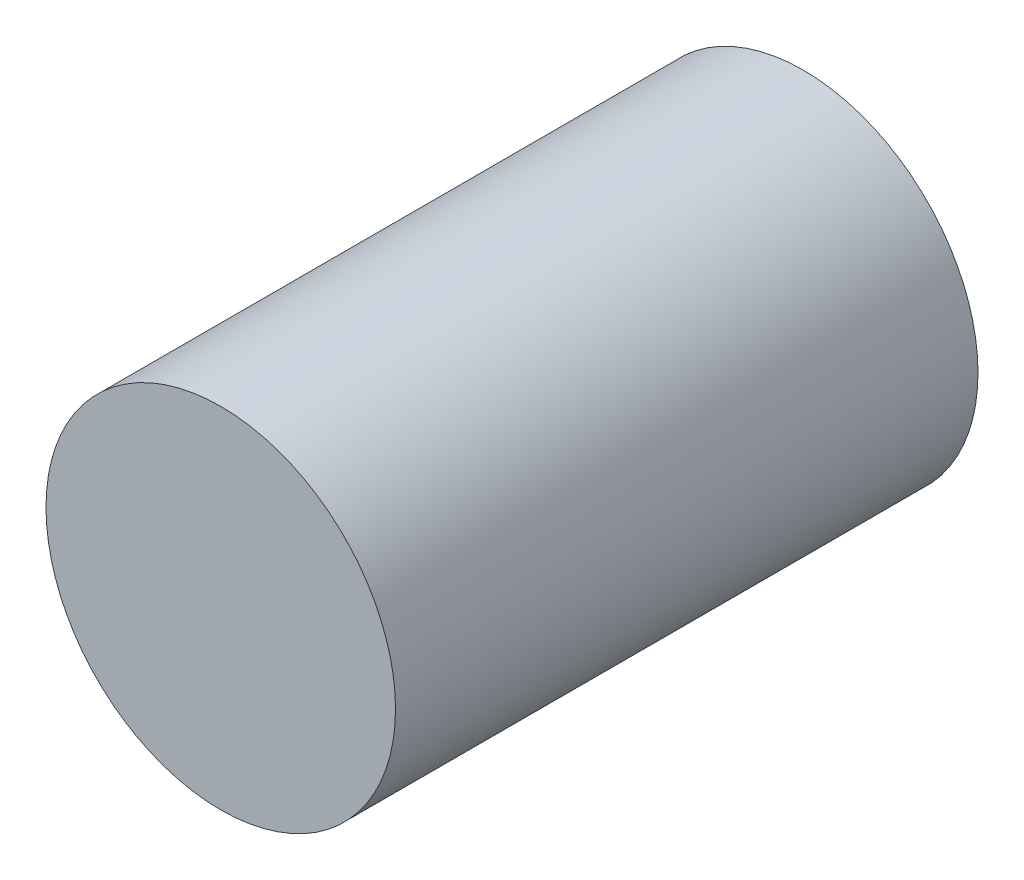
from build123d import *

# Parameters (mm, degrees)
ESQUISSE1_R      = 9
EXTRUSION1_DEPTH = 30


with BuildPart() as part:
    # Esquisse1 → Extrusion1 (new body)
    with BuildSketch(Plane.XY):
        Circle(ESQUISSE1_R)
    extrude(amount=EXTRUSION1_DEPTH)


solid = part.part
